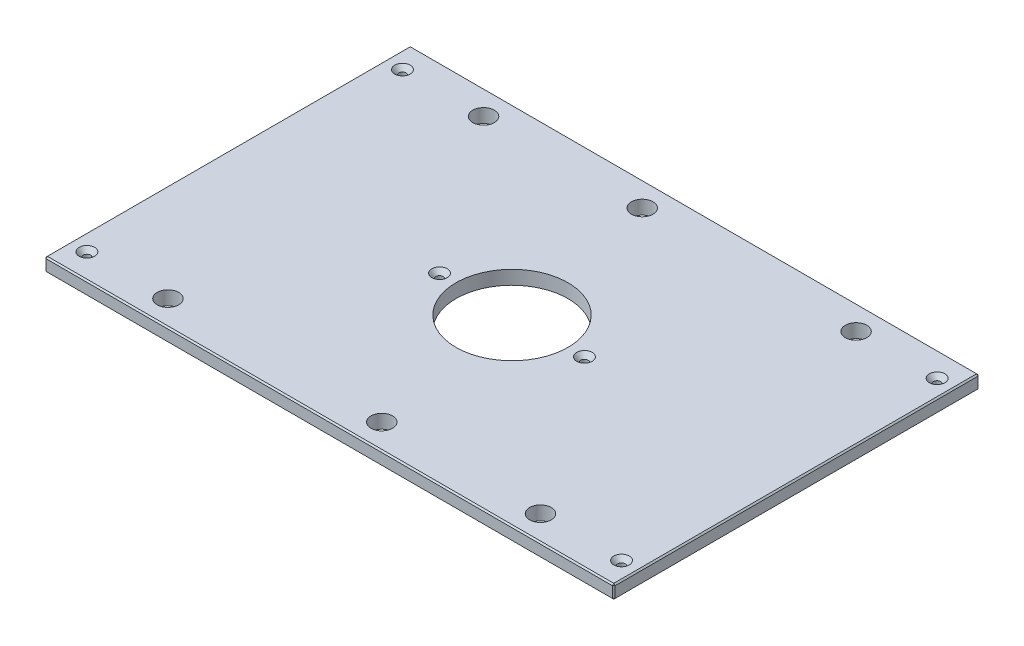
from build123d import *

# Parameters (mm, degrees)
SKETCH1_W                                        = 523.875
SKETCH1_H                                        = 336.55
BOSS_EXTRUDE1_DEPTH                              = 12.7
SKETCH13_R                                       = 51.562
CUT_EXTRUDE6_DEPTH                               = 312.591109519
F_25_32_0_78125_DIAMETER_HOLE1_D                 = 19.84375
CHAMFER2_SIZE                                    = 1.27
CSK_FOR_1_4_FLAT_HEAD_MACHINE_SCREW1_D           = 6.7564
CSK_FOR_1_4_FLAT_HEAD_MACHINE_SCREW1_CSINK_D     = 14.2748
CSK_FOR_1_4_FLAT_HEAD_MACHINE_SCREW1_CSINK_ANGLE = 82


with BuildPart() as part:
    # Sketch1 → Boss-Extrude1 (new body)
    with BuildSketch(Plane(origin=(0, 0, 0), x_dir=(1, 0, 0), z_dir=(0, 1, 0))):
        Rectangle(SKETCH1_W, SKETCH1_H)
    extrude(amount=BOSS_EXTRUDE1_DEPTH)

    # Sketch13 → Cut-Extrude6 (cut, through all)
    with BuildSketch(Plane(origin=(0, 12.7, 0), x_dir=(1, 0, 0), z_dir=(0, 1, 0))):
        with Locations(Location((0, 0, 0), (0, 0, 270))):
            Circle(SKETCH13_R)
    extrude(amount=-CUT_EXTRUDE6_DEPTH, mode=Mode.SUBTRACT)

    # 25_32 _0.78125_ Diameter Hole1 (through all)
    with Locations(Plane(origin=(0, 12.7, 0), x_dir=(1, 0, 0), z_dir=(0, 1, 0))):
        with Locations((171.45, 145.25498), (-171.45, 145.25498), (171.45, -145.25498), (-171.45, -145.25498), (-25.4, 145.25498), (25.4, -145.25498)):
            Hole(F_25_32_0_78125_DIAMETER_HOLE1_D / 2)

    # Chamfer2
    chamfer2_edges = [part.edges().sort_by_distance(p)[0] for p in [
        (261.9375, 12.7, 0),
        (0, 12.7, -168.275),
        (-261.9375, 12.7, 0),
        (0, 0, -168.275),
        (261.9375, 0, 0),
        (0, 0, 168.275),
        (-261.9375, 0, 0),
        (0, 12.7, 168.275),
        (-261.9375, 6.35, -168.275),
        (261.9375, 6.35, -168.275),
        (261.9375, 6.35, 168.275),
        (-261.9375, 6.35, 168.275),
    ]]
    chamfer(chamfer2_edges, length=CHAMFER2_SIZE)

    # CSK for 1_4 Flat Head Machine Screw1 (through all)
    with Locations(Plane(origin=(0, 12.7, 0), x_dir=(1, 0, 0), z_dir=(0, 1, 0))):
        with Locations((246.0625, 145.25498), (246.0625, -145.25498), (-246.0625, -145.25498), (-66.675, 0), (66.675, 0), (-246.0625, 145.25498), (-171.45, 145.25498), (-171.45, -145.25498)):
            CounterSinkHole(CSK_FOR_1_4_FLAT_HEAD_MACHINE_SCREW1_D / 2, CSK_FOR_1_4_FLAT_HEAD_MACHINE_SCREW1_CSINK_D / 2, counter_sink_angle=CSK_FOR_1_4_FLAT_HEAD_MACHINE_SCREW1_CSINK_ANGLE)


solid = part.part
